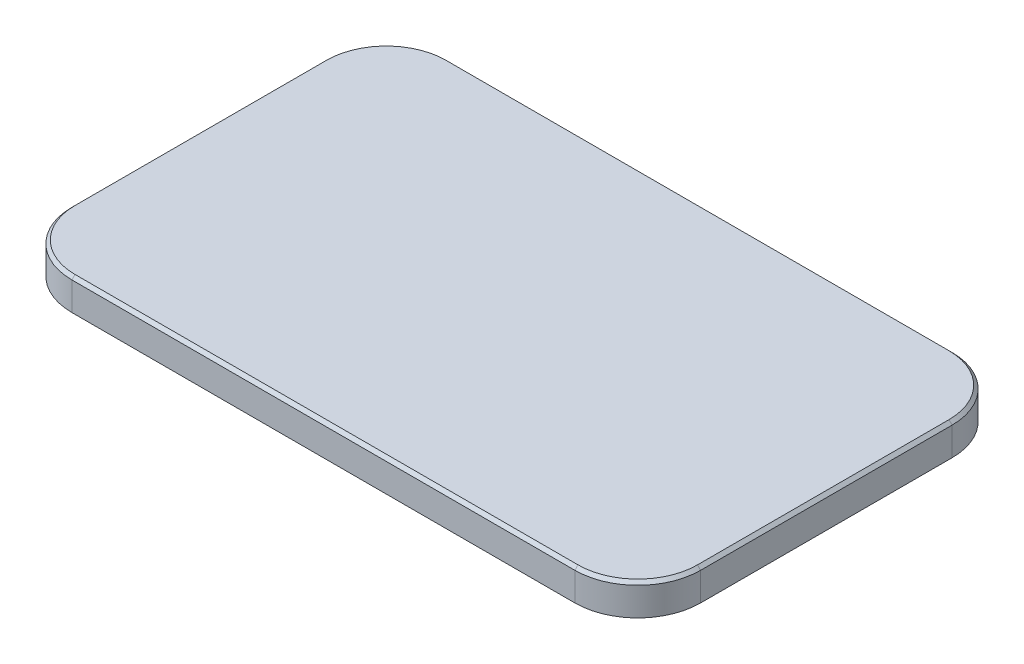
from build123d import *

# Parameters (mm, degrees)
SKETCH1_W      = 127
SKETCH1_H      = 76.2
EXTRUDE1_DEPTH = 6.35
FILLET1_R      = 12.7
CHAMFER1_SIZE  = 0.635


with BuildPart() as part:
    # Sketch1 → Extrude1 (new body)
    with BuildSketch(Plane(origin=(0, 0, 0), x_dir=(1, 0, 0), z_dir=(0, 1, 0))):
        Rectangle(SKETCH1_W, SKETCH1_H)
    extrude(amount=EXTRUDE1_DEPTH)

    # Fillet1
    fillet1_edges = [part.edges().sort_by_distance(p)[0] for p in [
        (-63.5, 3.175, -38.1),
        (63.5, 3.175, -38.1),
        (63.5, 3.175, 38.1),
        (-63.5, 3.175, 38.1),
    ]]
    fillet(fillet1_edges, radius=FILLET1_R)

    # Chamfer1
    chamfer1_edges = [part.edges().sort_by_distance(p)[0] for p in [
        (-63.5, 6.35, 0),
        (0, 6.35, -38.1),
        (0, 6.35, 38.1),
        (63.5, 6.35, 0),
        (59.780256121, 6.35, 34.380256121),
        (-59.780256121, 6.35, 34.380256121),
        (59.780256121, 6.35, -34.380256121),
        (-59.780256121, 6.35, -34.380256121),
    ]]
    chamfer(chamfer1_edges, length=CHAMFER1_SIZE)


solid = part.part
